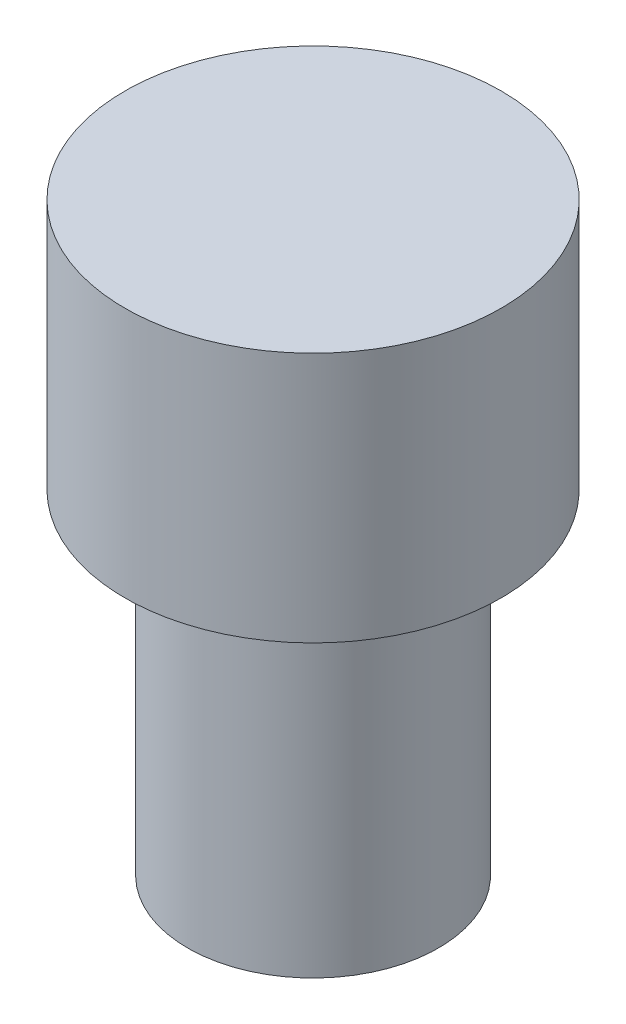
ISO-10303-21;
HEADER;
FILE_DESCRIPTION(('STEP AP214'),'2;1');
FILE_NAME('part.step','',(''),(''),'','','');
FILE_SCHEMA(('AUTOMOTIVE_DESIGN { 1 0 10303 214 1 1 1 1 }'));
ENDSEC;
DATA;
#1=APPLICATION_CONTEXT('core data for automotive mechanical design processes');
#2=APPLICATION_PROTOCOL_DEFINITION('international standard','automotive_design',2000,#1);
#3=PRODUCT_CONTEXT('',#1,'mechanical');
#4=PRODUCT('Part','Part','',(#3));
#5=PRODUCT_RELATED_PRODUCT_CATEGORY('part','',(#4));
#6=PRODUCT_DEFINITION_FORMATION('','',#4);
#7=PRODUCT_DEFINITION_CONTEXT('part definition',#1,'design');
#8=PRODUCT_DEFINITION('design','',#6,#7);
#9=PRODUCT_DEFINITION_SHAPE('','',#8);
#10=(LENGTH_UNIT() NAMED_UNIT(*) SI_UNIT(.MILLI.,.METRE.));
#11=(NAMED_UNIT(*) PLANE_ANGLE_UNIT() SI_UNIT($,.RADIAN.));
#12=(NAMED_UNIT(*) SI_UNIT($,.STERADIAN.) SOLID_ANGLE_UNIT());
#13=UNCERTAINTY_MEASURE_WITH_UNIT(LENGTH_MEASURE(1.E-05),#10,'distance_accuracy_value','');
#14=(GEOMETRIC_REPRESENTATION_CONTEXT(3) GLOBAL_UNCERTAINTY_ASSIGNED_CONTEXT((#13)) GLOBAL_UNIT_ASSIGNED_CONTEXT((#10,
#11,#12)) REPRESENTATION_CONTEXT('',''));
#15=CARTESIAN_POINT('',(0.,0.,0.));
#16=DIRECTION('',(0.,0.,1.));
#17=DIRECTION('',(1.,0.,0.));
#18=AXIS2_PLACEMENT_3D('',#15,#16,#17);
#19=CARTESIAN_POINT('',(1043.60545685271,1017.71700558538,1026.3829061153));
#20=DIRECTION('',(0.,1.,0.));
#21=DIRECTION('',(0.994667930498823,0.,0.103129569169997));
#22=AXIS2_PLACEMENT_3D('',#19,#20,#21);
#23=CYLINDRICAL_SURFACE('',#22,2.25000000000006);
#24=CARTESIAN_POINT('',(1043.60545685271,1020.71700558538,1026.3829061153));
#25=DIRECTION('',(0.,-1.,0.));
#26=DIRECTION('',(-0.994667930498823,0.,-0.103129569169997));
#27=AXIS2_PLACEMENT_3D('',#24,#25,#26);
#28=CIRCLE('',#27,2.25000000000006);
#29=CARTESIAN_POINT('',(1041.36745400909,1020.71700558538,1026.15086458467));
#30=VERTEX_POINT('',#29);
#31=EDGE_CURVE('E22',#30,#30,#28,.T.);
#32=ORIENTED_EDGE('',*,*,#31,.T.);
#33=EDGE_LOOP('',(#32));
#34=FACE_BOUND('',#33,.T.);
#35=CARTESIAN_POINT('',(1043.60545685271,1017.71700558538,1026.3829061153));
#36=DIRECTION('',(0.,-1.,0.));
#37=DIRECTION('',(-0.994667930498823,0.,-0.103129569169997));
#38=AXIS2_PLACEMENT_3D('',#35,#36,#37);
#39=CIRCLE('',#38,2.25000000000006);
#40=CARTESIAN_POINT('',(1041.36745400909,1017.71700558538,1026.15086458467));
#41=VERTEX_POINT('',#40);
#42=EDGE_CURVE('E10',#41,#41,#39,.T.);
#43=ORIENTED_EDGE('',*,*,#42,.F.);
#44=EDGE_LOOP('',(#43));
#45=FACE_BOUND('',#44,.T.);
#46=ADVANCED_FACE('F15',(#34,#45),#23,.T.);
#47=CARTESIAN_POINT('',(1043.60545685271,1017.71700558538,1026.3829061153));
#48=DIRECTION('',(0.,-1.,0.));
#49=DIRECTION('',(0.,0.,-1.));
#50=AXIS2_PLACEMENT_3D('',#47,#48,#49);
#51=PLANE('',#50);
#52=CARTESIAN_POINT('',(1043.60545685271,1017.71700558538,1026.3829061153));
#53=DIRECTION('',(0.,-1.,0.));
#54=DIRECTION('',(-0.994667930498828,0.,-0.103129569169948));
#55=AXIS2_PLACEMENT_3D('',#52,#53,#54);
#56=CIRCLE('',#55,1.50000000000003);
#57=CARTESIAN_POINT('',(1042.11345495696,1017.71700558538,1026.22821176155));
#58=VERTEX_POINT('',#57);
#59=EDGE_CURVE('E31',#58,#58,#56,.T.);
#60=ORIENTED_EDGE('',*,*,#59,.F.);
#61=EDGE_LOOP('',(#60));
#62=FACE_BOUND('',#61,.T.);
#63=ORIENTED_EDGE('',*,*,#42,.T.);
#64=EDGE_LOOP('',(#63));
#65=FACE_BOUND('',#64,.T.);
#66=ADVANCED_FACE('F60',(#62,#65),#51,.T.);
#67=CARTESIAN_POINT('',(1043.60545685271,1020.71700558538,1026.3829061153));
#68=DIRECTION('',(0.,-1.,0.));
#69=DIRECTION('',(0.,0.,-1.));
#70=AXIS2_PLACEMENT_3D('',#67,#68,#69);
#71=PLANE('',#70);
#72=ORIENTED_EDGE('',*,*,#31,.F.);
#73=EDGE_LOOP('',(#72));
#74=FACE_BOUND('',#73,.T.);
#75=ADVANCED_FACE('F51',(#74),#71,.F.);
#76=CARTESIAN_POINT('',(1043.60545685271,1013.71700558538,1026.3829061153));
#77=DIRECTION('',(0.,1.,0.));
#78=DIRECTION('',(0.994667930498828,0.,0.103129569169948));
#79=AXIS2_PLACEMENT_3D('',#76,#77,#78);
#80=CYLINDRICAL_SURFACE('',#79,1.50000000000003);
#81=ORIENTED_EDGE('',*,*,#59,.T.);
#82=EDGE_LOOP('',(#81));
#83=FACE_BOUND('',#82,.T.);
#84=CARTESIAN_POINT('',(1043.60545685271,1013.71700558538,1026.3829061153));
#85=DIRECTION('',(0.,-1.,0.));
#86=DIRECTION('',(-0.994667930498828,0.,-0.103129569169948));
#87=AXIS2_PLACEMENT_3D('',#84,#85,#86);
#88=CIRCLE('',#87,1.50000000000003);
#89=CARTESIAN_POINT('',(1042.11345495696,1013.71700558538,1026.22821176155));
#90=VERTEX_POINT('',#89);
#91=EDGE_CURVE('E38',#90,#90,#88,.T.);
#92=ORIENTED_EDGE('',*,*,#91,.F.);
#93=EDGE_LOOP('',(#92));
#94=FACE_BOUND('',#93,.T.);
#95=ADVANCED_FACE('F49',(#83,#94),#80,.T.);
#96=CARTESIAN_POINT('',(1043.60545685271,1013.71700558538,1026.3829061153));
#97=DIRECTION('',(0.,-1.,0.));
#98=DIRECTION('',(0.,0.,-1.));
#99=AXIS2_PLACEMENT_3D('',#96,#97,#98);
#100=PLANE('',#99);
#101=ORIENTED_EDGE('',*,*,#91,.T.);
#102=EDGE_LOOP('',(#101));
#103=FACE_BOUND('',#102,.T.);
#104=ADVANCED_FACE('F47',(#103),#100,.T.);
#105=CLOSED_SHELL('',(#46,#66,#75,#95,#104));
#106=MANIFOLD_SOLID_BREP('B1',#105);
#107=ADVANCED_BREP_SHAPE_REPRESENTATION('',(#18,#106),#14);
#108=SHAPE_DEFINITION_REPRESENTATION(#9,#107);
ENDSEC;
END-ISO-10303-21;
